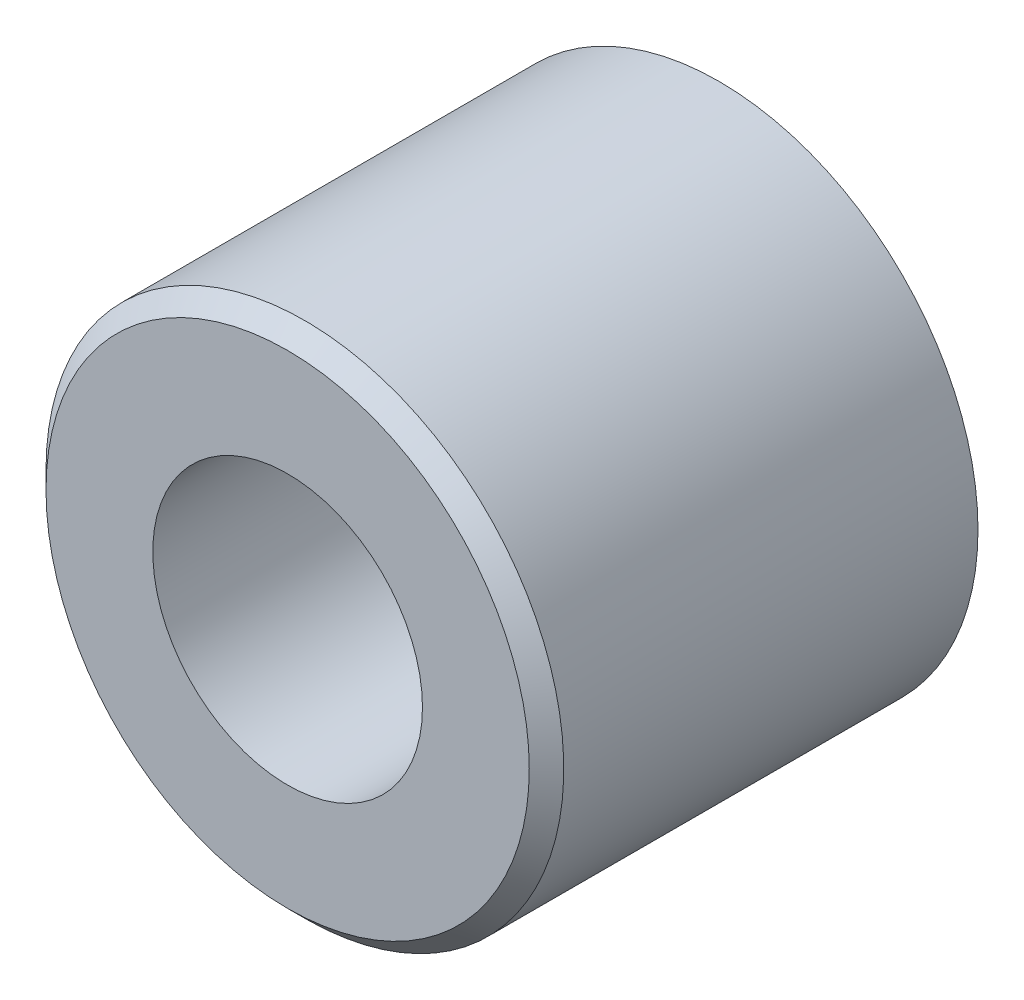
ISO-10303-21;
HEADER;
FILE_DESCRIPTION(('STEP AP214'),'2;1');
FILE_NAME('part.step','',(''),(''),'','','');
FILE_SCHEMA(('AUTOMOTIVE_DESIGN { 1 0 10303 214 1 1 1 1 }'));
ENDSEC;
DATA;
#1=APPLICATION_CONTEXT('core data for automotive mechanical design processes');
#2=APPLICATION_PROTOCOL_DEFINITION('international standard','automotive_design',2000,#1);
#3=PRODUCT_CONTEXT('',#1,'mechanical');
#4=PRODUCT('Part','Part','',(#3));
#5=PRODUCT_RELATED_PRODUCT_CATEGORY('part','',(#4));
#6=PRODUCT_DEFINITION_FORMATION('','',#4);
#7=PRODUCT_DEFINITION_CONTEXT('part definition',#1,'design');
#8=PRODUCT_DEFINITION('design','',#6,#7);
#9=PRODUCT_DEFINITION_SHAPE('','',#8);
#10=(LENGTH_UNIT() NAMED_UNIT(*) SI_UNIT(.MILLI.,.METRE.));
#11=(NAMED_UNIT(*) PLANE_ANGLE_UNIT() SI_UNIT($,.RADIAN.));
#12=(NAMED_UNIT(*) SI_UNIT($,.STERADIAN.) SOLID_ANGLE_UNIT());
#13=UNCERTAINTY_MEASURE_WITH_UNIT(LENGTH_MEASURE(1.E-05),#10,'distance_accuracy_value','');
#14=(GEOMETRIC_REPRESENTATION_CONTEXT(3) GLOBAL_UNCERTAINTY_ASSIGNED_CONTEXT((#13)) GLOBAL_UNIT_ASSIGNED_CONTEXT((#10,
#11,#12)) REPRESENTATION_CONTEXT('',''));
#15=CARTESIAN_POINT('',(0.,0.,0.));
#16=DIRECTION('',(0.,0.,1.));
#17=DIRECTION('',(1.,0.,0.));
#18=AXIS2_PLACEMENT_3D('',#15,#16,#17);
#19=CARTESIAN_POINT('',(0.,0.,10.));
#20=DIRECTION('',(0.,0.,1.));
#21=DIRECTION('',(1.,0.,0.));
#22=AXIS2_PLACEMENT_3D('',#19,#20,#21);
#23=PLANE('',#22);
#24=CARTESIAN_POINT('',(0.,0.,10.));
#25=DIRECTION('',(0.,0.,1.));
#26=DIRECTION('',(1.,0.,0.));
#27=AXIS2_PLACEMENT_3D('',#24,#25,#26);
#28=CIRCLE('',#27,5.6);
#29=CARTESIAN_POINT('',(-5.6,0.,10.));
#30=VERTEX_POINT('',#29);
#31=EDGE_CURVE('E38',#30,#30,#28,.T.);
#32=ORIENTED_EDGE('',*,*,#31,.T.);
#33=EDGE_LOOP('',(#32));
#34=FACE_BOUND('',#33,.T.);
#35=CARTESIAN_POINT('',(0.,0.,10.));
#36=DIRECTION('',(0.,0.,1.));
#37=DIRECTION('',(1.,0.,0.));
#38=AXIS2_PLACEMENT_3D('',#35,#36,#37);
#39=CIRCLE('',#38,3.125);
#40=CARTESIAN_POINT('',(3.125,0.,10.));
#41=VERTEX_POINT('',#40);
#42=EDGE_CURVE('E46',#41,#41,#39,.T.);
#43=ORIENTED_EDGE('',*,*,#42,.F.);
#44=EDGE_LOOP('',(#43));
#45=FACE_BOUND('',#44,.T.);
#46=ADVANCED_FACE('F31',(#34,#45),#23,.T.);
#47=CARTESIAN_POINT('',(0.,0.,0.));
#48=DIRECTION('',(0.,0.,1.));
#49=DIRECTION('',(1.,0.,0.));
#50=AXIS2_PLACEMENT_3D('',#47,#48,#49);
#51=PLANE('',#50);
#52=CARTESIAN_POINT('',(0.,0.,0.));
#53=DIRECTION('',(0.,0.,1.));
#54=DIRECTION('',(1.,0.,0.));
#55=AXIS2_PLACEMENT_3D('',#52,#53,#54);
#56=CIRCLE('',#55,6.);
#57=CARTESIAN_POINT('',(6.,0.,0.));
#58=VERTEX_POINT('',#57);
#59=EDGE_CURVE('E42',#58,#58,#56,.T.);
#60=ORIENTED_EDGE('',*,*,#59,.F.);
#61=EDGE_LOOP('',(#60));
#62=FACE_BOUND('',#61,.T.);
#63=CARTESIAN_POINT('',(0.,0.,0.));
#64=DIRECTION('',(0.,0.,1.));
#65=DIRECTION('',(1.,0.,0.));
#66=AXIS2_PLACEMENT_3D('',#63,#64,#65);
#67=CIRCLE('',#66,3.125);
#68=CARTESIAN_POINT('',(3.125,0.,0.));
#69=VERTEX_POINT('',#68);
#70=EDGE_CURVE('E49',#69,#69,#67,.T.);
#71=ORIENTED_EDGE('',*,*,#70,.T.);
#72=EDGE_LOOP('',(#71));
#73=FACE_BOUND('',#72,.T.);
#74=ADVANCED_FACE('F59',(#62,#73),#51,.F.);
#75=CARTESIAN_POINT('',(0.,0.,10.));
#76=DIRECTION('',(0.,0.,-1.));
#77=DIRECTION('',(-1.,0.,0.));
#78=AXIS2_PLACEMENT_3D('',#75,#76,#77);
#79=CYLINDRICAL_SURFACE('',#78,6.);
#80=CARTESIAN_POINT('',(0.,0.,9.6));
#81=DIRECTION('',(0.,0.,1.));
#82=DIRECTION('',(1.,0.,0.));
#83=AXIS2_PLACEMENT_3D('',#80,#81,#82);
#84=CIRCLE('',#83,6.);
#85=CARTESIAN_POINT('',(-6.,0.,9.6));
#86=VERTEX_POINT('',#85);
#87=EDGE_CURVE('E10',#86,#86,#84,.F.);
#88=ORIENTED_EDGE('',*,*,#87,.T.);
#89=EDGE_LOOP('',(#88));
#90=FACE_BOUND('',#89,.T.);
#91=ORIENTED_EDGE('',*,*,#59,.T.);
#92=EDGE_LOOP('',(#91));
#93=FACE_BOUND('',#92,.T.);
#94=ADVANCED_FACE('F64',(#90,#93),#79,.T.);
#95=CARTESIAN_POINT('',(0.,0.,10.));
#96=DIRECTION('',(0.,0.,-1.));
#97=DIRECTION('',(-1.,0.,0.));
#98=AXIS2_PLACEMENT_3D('',#95,#96,#97);
#99=CYLINDRICAL_SURFACE('',#98,3.125);
#100=ORIENTED_EDGE('',*,*,#42,.T.);
#101=EDGE_LOOP('',(#100));
#102=FACE_BOUND('',#101,.T.);
#103=ORIENTED_EDGE('',*,*,#70,.F.);
#104=EDGE_LOOP('',(#103));
#105=FACE_BOUND('',#104,.T.);
#106=ADVANCED_FACE('F55',(#102,#105),#99,.F.);
#107=CARTESIAN_POINT('',(0.,0.,10.));
#108=DIRECTION('',(0.,0.,-1.));
#109=DIRECTION('',(-1.,0.,0.));
#110=AXIS2_PLACEMENT_3D('',#107,#108,#109);
#111=CONICAL_SURFACE('',#110,5.6,0.785398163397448);
#112=CARTESIAN_POINT('',(-6.,0.,9.6));
#113=CARTESIAN_POINT('',(-5.99583333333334,0.,9.60416666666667));
#114=CARTESIAN_POINT('',(-5.99166666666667,0.,9.60833333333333));
#115=CARTESIAN_POINT('',(-5.98333333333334,0.,9.61666666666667));
#116=CARTESIAN_POINT('',(-5.97916666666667,0.,9.62083333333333));
#117=CARTESIAN_POINT('',(-5.97083333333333,0.,9.62916666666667));
#118=CARTESIAN_POINT('',(-5.96666666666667,0.,9.63333333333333));
#119=CARTESIAN_POINT('',(-5.95833333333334,0.,9.64166666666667));
#120=CARTESIAN_POINT('',(-5.95416666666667,0.,9.64583333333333));
#121=CARTESIAN_POINT('',(-5.94583333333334,0.,9.65416666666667));
#122=CARTESIAN_POINT('',(-5.94166666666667,0.,9.65833333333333));
#123=CARTESIAN_POINT('',(-5.93333333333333,0.,9.66666666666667));
#124=CARTESIAN_POINT('',(-5.92916666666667,0.,9.67083333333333));
#125=CARTESIAN_POINT('',(-5.92083333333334,0.,9.67916666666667));
#126=CARTESIAN_POINT('',(-5.91666666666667,0.,9.68333333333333));
#127=CARTESIAN_POINT('',(-5.90833333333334,0.,9.69166666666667));
#128=CARTESIAN_POINT('',(-5.90416666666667,0.,9.69583333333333));
#129=CARTESIAN_POINT('',(-5.89583333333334,0.,9.70416666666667));
#130=CARTESIAN_POINT('',(-5.89166666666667,0.,9.70833333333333));
#131=CARTESIAN_POINT('',(-5.88333333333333,0.,9.71666666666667));
#132=CARTESIAN_POINT('',(-5.87916666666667,0.,9.72083333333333));
#133=CARTESIAN_POINT('',(-5.87083333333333,0.,9.72916666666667));
#134=CARTESIAN_POINT('',(-5.86666666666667,0.,9.73333333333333));
#135=CARTESIAN_POINT('',(-5.85833333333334,0.,9.74166666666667));
#136=CARTESIAN_POINT('',(-5.85416666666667,0.,9.74583333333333));
#137=CARTESIAN_POINT('',(-5.84583333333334,0.,9.75416666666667));
#138=CARTESIAN_POINT('',(-5.84166666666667,0.,9.75833333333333));
#139=CARTESIAN_POINT('',(-5.83333333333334,0.,9.76666666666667));
#140=CARTESIAN_POINT('',(-5.82916666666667,0.,9.77083333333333));
#141=CARTESIAN_POINT('',(-5.82083333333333,0.,9.77916666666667));
#142=CARTESIAN_POINT('',(-5.81666666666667,0.,9.78333333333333));
#143=CARTESIAN_POINT('',(-5.80833333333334,0.,9.79166666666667));
#144=CARTESIAN_POINT('',(-5.80416666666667,0.,9.79583333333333));
#145=CARTESIAN_POINT('',(-5.79583333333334,0.,9.80416666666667));
#146=CARTESIAN_POINT('',(-5.79166666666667,0.,9.80833333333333));
#147=CARTESIAN_POINT('',(-5.78333333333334,0.,9.81666666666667));
#148=CARTESIAN_POINT('',(-5.77916666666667,0.,9.82083333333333));
#149=CARTESIAN_POINT('',(-5.77083333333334,0.,9.82916666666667));
#150=CARTESIAN_POINT('',(-5.76666666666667,0.,9.83333333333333));
#151=CARTESIAN_POINT('',(-5.75833333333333,0.,9.84166666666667));
#152=CARTESIAN_POINT('',(-5.75416666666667,0.,9.84583333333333));
#153=CARTESIAN_POINT('',(-5.74583333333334,0.,9.85416666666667));
#154=CARTESIAN_POINT('',(-5.74166666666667,0.,9.85833333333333));
#155=CARTESIAN_POINT('',(-5.73333333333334,0.,9.86666666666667));
#156=CARTESIAN_POINT('',(-5.72916666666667,0.,9.87083333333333));
#157=CARTESIAN_POINT('',(-5.72083333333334,0.,9.87916666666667));
#158=CARTESIAN_POINT('',(-5.71666666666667,0.,9.88333333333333));
#159=CARTESIAN_POINT('',(-5.70833333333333,0.,9.89166666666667));
#160=CARTESIAN_POINT('',(-5.70416666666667,0.,9.89583333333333));
#161=CARTESIAN_POINT('',(-5.69583333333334,0.,9.90416666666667));
#162=CARTESIAN_POINT('',(-5.69166666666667,0.,9.90833333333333));
#163=CARTESIAN_POINT('',(-5.68333333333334,0.,9.91666666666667));
#164=CARTESIAN_POINT('',(-5.67916666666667,0.,9.92083333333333));
#165=CARTESIAN_POINT('',(-5.67083333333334,0.,9.92916666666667));
#166=CARTESIAN_POINT('',(-5.66666666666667,0.,9.93333333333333));
#167=CARTESIAN_POINT('',(-5.65833333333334,0.,9.94166666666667));
#168=CARTESIAN_POINT('',(-5.65416666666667,0.,9.94583333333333));
#169=CARTESIAN_POINT('',(-5.64583333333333,0.,9.95416666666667));
#170=CARTESIAN_POINT('',(-5.64166666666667,0.,9.95833333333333));
#171=CARTESIAN_POINT('',(-5.63333333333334,0.,9.96666666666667));
#172=CARTESIAN_POINT('',(-5.62916666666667,0.,9.97083333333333));
#173=CARTESIAN_POINT('',(-5.62083333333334,0.,9.97916666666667));
#174=CARTESIAN_POINT('',(-5.61666666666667,0.,9.98333333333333));
#175=CARTESIAN_POINT('',(-5.60833333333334,0.,9.99166666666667));
#176=CARTESIAN_POINT('',(-5.60416666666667,0.,9.99583333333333));
#177=CARTESIAN_POINT('',(-5.6,0.,10.));
#178=B_SPLINE_CURVE_WITH_KNOTS('',3,(#112,#113,#114,#115,#116,#117,#118,#119,#120,#121,#122,
#123,#124,#125,#126,#127,#128,#129,#130,#131,#132,#133,#134,#135,#136,#137,#138,#139,#140,#141,
#142,#143,#144,#145,#146,#147,#148,#149,#150,#151,#152,#153,#154,#155,#156,#157,#158,#159,#160,
#161,#162,#163,#164,#165,#166,#167,#168,#169,#170,#171,#172,#173,#174,#175,#176,#177),
.UNSPECIFIED.,.F.,.F.,(4,2,2,2,2,2,2,2,2,2,2,2,2,2,2,2,2,2,2,2,2,2,2,2,2,2,2,2,2,2,2,2,4),(0.,
0.0176776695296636,0.0353553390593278,0.053033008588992,0.0707106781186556,0.0883883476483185,
0.106066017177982,0.123743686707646,0.14142135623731,0.159099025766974,0.176776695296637,
0.194454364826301,0.212132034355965,0.229809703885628,0.247487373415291,0.265165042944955,
0.282842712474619,0.300520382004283,0.318198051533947,0.33587572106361,0.353553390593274,
0.371231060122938,0.388908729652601,0.406586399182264,0.424264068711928,0.441941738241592,
0.459619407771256,0.47729707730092,0.494974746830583,0.512652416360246,0.530330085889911,
0.548007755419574,0.565685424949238),.UNSPECIFIED.);
#179=EDGE_CURVE('BSEAM33',#86,#30,#178,.T.);
#180=ORIENTED_EDGE('',*,*,#87,.F.);
#181=ORIENTED_EDGE('',*,*,#31,.F.);
#182=ORIENTED_EDGE('',*,*,#179,.T.);
#183=ORIENTED_EDGE('',*,*,#179,.F.);
#184=EDGE_LOOP('',(#180,#182,#181,#183));
#185=FACE_BOUND('',#184,.T.);
#186=ADVANCED_FACE('F33',(#185),#111,.T.);
#187=CLOSED_SHELL('',(#46,#74,#94,#106,#186));
#188=MANIFOLD_SOLID_BREP('B2',#187);
#189=ADVANCED_BREP_SHAPE_REPRESENTATION('',(#18,#188),#14);
#190=SHAPE_DEFINITION_REPRESENTATION(#9,#189);
ENDSEC;
END-ISO-10303-21;
